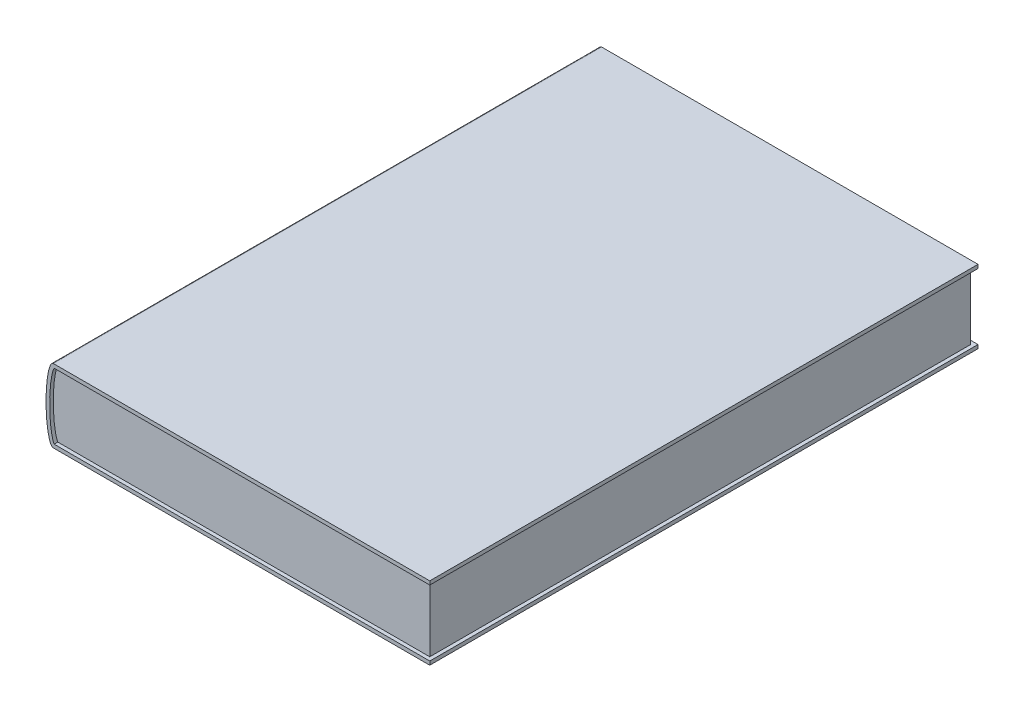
ISO-10303-21;
HEADER;
FILE_DESCRIPTION(('STEP AP214'),'2;1');
FILE_NAME('part.step','',(''),(''),'','','');
FILE_SCHEMA(('AUTOMOTIVE_DESIGN { 1 0 10303 214 1 1 1 1 }'));
ENDSEC;
DATA;
#1=APPLICATION_CONTEXT('core data for automotive mechanical design processes');
#2=APPLICATION_PROTOCOL_DEFINITION('international standard','automotive_design',2000,#1);
#3=PRODUCT_CONTEXT('',#1,'mechanical');
#4=PRODUCT('Part','Part','',(#3));
#5=PRODUCT_RELATED_PRODUCT_CATEGORY('part','',(#4));
#6=PRODUCT_DEFINITION_FORMATION('','',#4);
#7=PRODUCT_DEFINITION_CONTEXT('part definition',#1,'design');
#8=PRODUCT_DEFINITION('design','',#6,#7);
#9=PRODUCT_DEFINITION_SHAPE('','',#8);
#10=(LENGTH_UNIT() NAMED_UNIT(*) SI_UNIT(.MILLI.,.METRE.));
#11=(NAMED_UNIT(*) PLANE_ANGLE_UNIT() SI_UNIT($,.RADIAN.));
#12=(NAMED_UNIT(*) SI_UNIT($,.STERADIAN.) SOLID_ANGLE_UNIT());
#13=UNCERTAINTY_MEASURE_WITH_UNIT(LENGTH_MEASURE(1.E-05),#10,'distance_accuracy_value','');
#14=(GEOMETRIC_REPRESENTATION_CONTEXT(3) GLOBAL_UNCERTAINTY_ASSIGNED_CONTEXT((#13)) GLOBAL_UNIT_ASSIGNED_CONTEXT((#10,
#11,#12)) REPRESENTATION_CONTEXT('',''));
#15=CARTESIAN_POINT('',(0.,0.,0.));
#16=DIRECTION('',(0.,0.,1.));
#17=DIRECTION('',(1.,0.,0.));
#18=AXIS2_PLACEMENT_3D('',#15,#16,#17);
#19=CARTESIAN_POINT('',(-102.515867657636,-17.9999999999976,150.));
#20=DIRECTION('',(0.,-1.,0.));
#21=DIRECTION('',(1.,0.,0.));
#22=AXIS2_PLACEMENT_3D('',#19,#20,#21);
#23=PLANE('',#22);
#24=DIRECTION('',(1.,0.,0.));
#25=VECTOR('',#24,1.);
#26=CARTESIAN_POINT('',(-102.515867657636,-17.9999999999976,148.));
#27=LINE('',#26,#25);
#28=CARTESIAN_POINT('',(-102.515867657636,-17.9999999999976,148.));
#29=VERTEX_POINT('',#28);
#30=CARTESIAN_POINT('',(101.,-17.9999999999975,148.));
#31=VERTEX_POINT('',#30);
#32=EDGE_CURVE('E252',#29,#31,#27,.T.);
#33=ORIENTED_EDGE('',*,*,#32,.F.);
#34=DIRECTION('',(0.,0.,-1.));
#35=VECTOR('',#34,1.);
#36=CARTESIAN_POINT('',(-102.515867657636,-17.9999999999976,150.));
#37=LINE('',#36,#35);
#38=CARTESIAN_POINT('',(-102.515867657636,-17.9999999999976,150.));
#39=VERTEX_POINT('',#38);
#40=EDGE_CURVE('E47',#39,#29,#37,.T.);
#41=ORIENTED_EDGE('',*,*,#40,.F.);
#42=DIRECTION('',(-1.,0.,0.));
#43=VECTOR('',#42,1.);
#44=CARTESIAN_POINT('',(-102.515867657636,-17.9999999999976,150.));
#45=LINE('',#44,#43);
#46=CARTESIAN_POINT('',(103.,-18.,150.));
#47=VERTEX_POINT('',#46);
#48=EDGE_CURVE('E104',#47,#39,#45,.T.);
#49=ORIENTED_EDGE('',*,*,#48,.F.);
#50=DIRECTION('',(0.,0.,-1.));
#51=VECTOR('',#50,1.);
#52=CARTESIAN_POINT('',(103.,-18.,150.));
#53=LINE('',#52,#51);
#54=CARTESIAN_POINT('',(103.,-18.,-150.));
#55=VERTEX_POINT('',#54);
#56=EDGE_CURVE('E11',#47,#55,#53,.T.);
#57=ORIENTED_EDGE('',*,*,#56,.T.);
#58=DIRECTION('',(-1.,0.,0.));
#59=VECTOR('',#58,1.);
#60=CARTESIAN_POINT('',(-102.515867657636,-17.9999999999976,-150.));
#61=LINE('',#60,#59);
#62=CARTESIAN_POINT('',(-102.515867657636,-17.9999999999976,-150.));
#63=VERTEX_POINT('',#62);
#64=EDGE_CURVE('E212',#55,#63,#61,.T.);
#65=ORIENTED_EDGE('',*,*,#64,.T.);
#66=CARTESIAN_POINT('',(-102.515867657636,-17.9999999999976,-148.));
#67=VERTEX_POINT('',#66);
#68=EDGE_CURVE('E199',#67,#63,#37,.T.);
#69=ORIENTED_EDGE('',*,*,#68,.F.);
#70=DIRECTION('',(1.,0.,0.));
#71=VECTOR('',#70,1.);
#72=CARTESIAN_POINT('',(-102.515867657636,-17.9999999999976,-148.));
#73=LINE('',#72,#71);
#74=CARTESIAN_POINT('',(101.,-17.9999999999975,-148.));
#75=VERTEX_POINT('',#74);
#76=EDGE_CURVE('E267',#67,#75,#73,.T.);
#77=ORIENTED_EDGE('',*,*,#76,.T.);
#78=DIRECTION('',(0.,0.,-1.));
#79=VECTOR('',#78,1.);
#80=CARTESIAN_POINT('',(101.,-17.9999999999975,148.));
#81=LINE('',#80,#79);
#82=EDGE_CURVE('E236',#31,#75,#81,.T.);
#83=ORIENTED_EDGE('',*,*,#82,.F.);
#84=EDGE_LOOP('',(#33,#41,#49,#57,#65,#69,#77,#83));
#85=FACE_BOUND('',#84,.T.);
#86=ADVANCED_FACE('F39',(#85),#23,.F.);
#87=CARTESIAN_POINT('',(-102.515867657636,-17.9999999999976,150.));
#88=CARTESIAN_POINT('',(-102.54790510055,-17.9493335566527,150.));
#89=CARTESIAN_POINT('',(-102.603716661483,-17.8548623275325,150.));
#90=CARTESIAN_POINT('',(-102.743990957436,-17.5881350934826,150.));
#91=CARTESIAN_POINT('',(-102.93212011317,-17.1643070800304,150.));
#92=CARTESIAN_POINT('',(-103.169750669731,-16.5114393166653,150.));
#93=CARTESIAN_POINT('',(-103.485635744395,-15.4715657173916,150.));
#94=CARTESIAN_POINT('',(-103.863661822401,-13.8798777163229,150.));
#95=CARTESIAN_POINT('',(-104.260229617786,-11.5815238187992,150.));
#96=CARTESIAN_POINT('',(-104.583265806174,-8.96782562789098,150.));
#97=CARTESIAN_POINT('',(-104.900962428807,-5.16281343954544,150.));
#98=CARTESIAN_POINT('',(-105.066025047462,7.0384236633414E-12,150.));
#99=CARTESIAN_POINT('',(-104.900962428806,5.1628134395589,150.));
#100=CARTESIAN_POINT('',(-104.583265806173,8.96782562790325,150.));
#101=CARTESIAN_POINT('',(-104.260229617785,11.5815238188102,150.));
#102=CARTESIAN_POINT('',(-103.863661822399,13.8798777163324,150.));
#103=CARTESIAN_POINT('',(-103.485635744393,15.4715657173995,150.));
#104=CARTESIAN_POINT('',(-103.169750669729,16.5114393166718,150.));
#105=CARTESIAN_POINT('',(-102.932120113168,17.1643070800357,150.));
#106=CARTESIAN_POINT('',(-102.743990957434,17.5881350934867,150.));
#107=CARTESIAN_POINT('',(-102.603716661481,17.8548623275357,150.));
#108=CARTESIAN_POINT('',(-102.547905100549,17.9493335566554,150.));
#109=CARTESIAN_POINT('',(-102.515867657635,18.,150.));
#110=B_SPLINE_CURVE_WITH_KNOTS('',3,(#87,#88,#89,#90,#91,#92,#93,#94,#95,#96,#97,#98,#99,#100,
#101,#102,#103,#104,#105,#106,#107,#108,#109),.UNSPECIFIED.,.F.,.F.,(4,1,1,1,1,1,1,1,1,1,1,1,1,
1,1,1,1,1,1,1,4),(0.306338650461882,0.345852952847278,0.385367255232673,0.464395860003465,
0.543424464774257,0.622453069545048,0.780510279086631,0.938567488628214,1.0966246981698,
1.25468190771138,1.57079632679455,1.88691074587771,2.04496795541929,2.20302516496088,
2.36108237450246,2.51913958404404,2.59816818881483,2.67719679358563,2.75622539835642,
2.79573970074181,2.83525400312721),.UNSPECIFIED.);
#111=DIRECTION('',(0.,0.,-1.));
#112=VECTOR('',#111,1.);
#113=SURFACE_OF_LINEAR_EXTRUSION('',#110,#112);
#114=CARTESIAN_POINT('',(-102.515867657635,18.,148.));
#115=CARTESIAN_POINT('',(-102.547905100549,17.9493335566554,148.));
#116=CARTESIAN_POINT('',(-102.603716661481,17.8548623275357,148.));
#117=CARTESIAN_POINT('',(-102.743990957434,17.5881350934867,148.));
#118=CARTESIAN_POINT('',(-102.932120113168,17.1643070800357,148.));
#119=CARTESIAN_POINT('',(-103.169750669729,16.5114393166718,148.));
#120=CARTESIAN_POINT('',(-103.485635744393,15.4715657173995,148.));
#121=CARTESIAN_POINT('',(-103.863661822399,13.8798777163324,148.));
#122=CARTESIAN_POINT('',(-104.260229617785,11.5815238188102,148.));
#123=CARTESIAN_POINT('',(-104.583265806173,8.96782562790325,148.));
#124=CARTESIAN_POINT('',(-104.900962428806,5.1628134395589,148.));
#125=CARTESIAN_POINT('',(-105.066025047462,7.0384236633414E-12,148.));
#126=CARTESIAN_POINT('',(-104.900962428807,-5.16281343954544,148.));
#127=CARTESIAN_POINT('',(-104.583265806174,-8.96782562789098,148.));
#128=CARTESIAN_POINT('',(-104.260229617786,-11.5815238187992,148.));
#129=CARTESIAN_POINT('',(-103.863661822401,-13.8798777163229,148.));
#130=CARTESIAN_POINT('',(-103.485635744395,-15.4715657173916,148.));
#131=CARTESIAN_POINT('',(-103.169750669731,-16.5114393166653,148.));
#132=CARTESIAN_POINT('',(-102.93212011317,-17.1643070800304,148.));
#133=CARTESIAN_POINT('',(-102.743990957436,-17.5881350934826,148.));
#134=CARTESIAN_POINT('',(-102.603716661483,-17.8548623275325,148.));
#135=CARTESIAN_POINT('',(-102.54790510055,-17.9493335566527,148.));
#136=CARTESIAN_POINT('',(-102.515867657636,-17.9999999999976,148.));
#137=B_SPLINE_CURVE_WITH_KNOTS('',3,(#114,#115,#116,#117,#118,#119,#120,#121,#122,#123,#124,
#125,#126,#127,#128,#129,#130,#131,#132,#133,#134,#135,#136),.UNSPECIFIED.,.F.,.F.,(4,1,1,1,1,1,
1,1,1,1,1,1,1,1,1,1,1,1,1,1,4),(0.306338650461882,0.345852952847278,0.385367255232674,
0.464395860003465,0.543424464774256,0.622453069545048,0.780510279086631,0.938567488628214,
1.0966246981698,1.25468190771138,1.57079632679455,1.88691074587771,2.04496795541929,
2.20302516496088,2.36108237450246,2.51913958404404,2.59816818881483,2.67719679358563,
2.75622539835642,2.79573970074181,2.83525400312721),.UNSPECIFIED.);
#138=CARTESIAN_POINT('',(-102.515867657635,18.,148.));
#139=VERTEX_POINT('',#138);
#140=EDGE_CURVE('E255',#139,#29,#137,.T.);
#141=ORIENTED_EDGE('',*,*,#140,.F.);
#142=DIRECTION('',(0.,0.,-1.));
#143=VECTOR('',#142,1.);
#144=CARTESIAN_POINT('',(-102.515867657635,18.,150.));
#145=LINE('',#144,#143);
#146=CARTESIAN_POINT('',(-102.515867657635,18.,150.));
#147=VERTEX_POINT('',#146);
#148=EDGE_CURVE('E198',#147,#139,#145,.T.);
#149=ORIENTED_EDGE('',*,*,#148,.F.);
#150=EDGE_CURVE('E170',#39,#147,#110,.T.);
#151=ORIENTED_EDGE('',*,*,#150,.F.);
#152=ORIENTED_EDGE('',*,*,#40,.T.);
#153=EDGE_LOOP('',(#141,#149,#151,#152));
#154=FACE_BOUND('',#153,.T.);
#155=ADVANCED_FACE('F165',(#154),#113,.F.);
#156=CARTESIAN_POINT('',(103.,18.,150.));
#157=DIRECTION('',(0.,1.,0.));
#158=DIRECTION('',(0.,0.,1.));
#159=AXIS2_PLACEMENT_3D('',#156,#157,#158);
#160=PLANE('',#159);
#161=DIRECTION('',(-1.,0.,0.));
#162=VECTOR('',#161,1.);
#163=CARTESIAN_POINT('',(101.,18.,148.));
#164=LINE('',#163,#162);
#165=CARTESIAN_POINT('',(101.,18.,148.));
#166=VERTEX_POINT('',#165);
#167=EDGE_CURVE('E257',#166,#139,#164,.T.);
#168=ORIENTED_EDGE('',*,*,#167,.F.);
#169=DIRECTION('',(0.,0.,-1.));
#170=VECTOR('',#169,1.);
#171=CARTESIAN_POINT('',(101.,18.,148.));
#172=LINE('',#171,#170);
#173=CARTESIAN_POINT('',(101.,18.,-148.));
#174=VERTEX_POINT('',#173);
#175=EDGE_CURVE('E238',#166,#174,#172,.T.);
#176=ORIENTED_EDGE('',*,*,#175,.T.);
#177=DIRECTION('',(-1.,0.,0.));
#178=VECTOR('',#177,1.);
#179=CARTESIAN_POINT('',(101.,18.,-148.));
#180=LINE('',#179,#178);
#181=CARTESIAN_POINT('',(-102.515867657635,18.,-148.));
#182=VERTEX_POINT('',#181);
#183=EDGE_CURVE('E271',#174,#182,#180,.T.);
#184=ORIENTED_EDGE('',*,*,#183,.T.);
#185=CARTESIAN_POINT('',(-102.515867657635,18.,-150.));
#186=VERTEX_POINT('',#185);
#187=EDGE_CURVE('E192',#182,#186,#145,.T.);
#188=ORIENTED_EDGE('',*,*,#187,.T.);
#189=DIRECTION('',(1.,0.,0.));
#190=VECTOR('',#189,1.);
#191=CARTESIAN_POINT('',(103.,18.,-150.));
#192=LINE('',#191,#190);
#193=CARTESIAN_POINT('',(103.,18.,-150.));
#194=VERTEX_POINT('',#193);
#195=EDGE_CURVE('E190',#186,#194,#192,.T.);
#196=ORIENTED_EDGE('',*,*,#195,.T.);
#197=DIRECTION('',(0.,0.,-1.));
#198=VECTOR('',#197,1.);
#199=CARTESIAN_POINT('',(103.,18.,150.));
#200=LINE('',#199,#198);
#201=CARTESIAN_POINT('',(103.,18.,150.));
#202=VERTEX_POINT('',#201);
#203=EDGE_CURVE('E187',#202,#194,#200,.T.);
#204=ORIENTED_EDGE('',*,*,#203,.F.);
#205=DIRECTION('',(1.,0.,0.));
#206=VECTOR('',#205,1.);
#207=CARTESIAN_POINT('',(103.,18.,150.));
#208=LINE('',#207,#206);
#209=EDGE_CURVE('E176',#147,#202,#208,.T.);
#210=ORIENTED_EDGE('',*,*,#209,.F.);
#211=ORIENTED_EDGE('',*,*,#148,.T.);
#212=EDGE_LOOP('',(#168,#176,#184,#188,#196,#204,#210,#211));
#213=FACE_BOUND('',#212,.T.);
#214=ADVANCED_FACE('F162',(#213),#160,.F.);
#215=CARTESIAN_POINT('',(103.,-18.,150.));
#216=DIRECTION('',(-1.,0.,0.));
#217=DIRECTION('',(0.,0.,1.));
#218=AXIS2_PLACEMENT_3D('',#215,#216,#217);
#219=PLANE('',#218);
#220=DIRECTION('',(0.,1.,0.));
#221=VECTOR('',#220,1.);
#222=CARTESIAN_POINT('',(103.,-18.,-150.));
#223=LINE('',#222,#221);
#224=CARTESIAN_POINT('',(103.,-19.9999999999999,-150.));
#225=VERTEX_POINT('',#224);
#226=EDGE_CURVE('E218',#225,#55,#223,.T.);
#227=ORIENTED_EDGE('',*,*,#226,.T.);
#228=ORIENTED_EDGE('',*,*,#56,.F.);
#229=DIRECTION('',(0.,1.,0.));
#230=VECTOR('',#229,1.);
#231=CARTESIAN_POINT('',(103.,-18.,150.));
#232=LINE('',#231,#230);
#233=CARTESIAN_POINT('',(103.,-19.9999999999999,150.));
#234=VERTEX_POINT('',#233);
#235=EDGE_CURVE('E234',#234,#47,#232,.T.);
#236=ORIENTED_EDGE('',*,*,#235,.F.);
#237=DIRECTION('',(0.,0.,-1.));
#238=VECTOR('',#237,1.);
#239=CARTESIAN_POINT('',(103.,-19.9999999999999,150.));
#240=LINE('',#239,#238);
#241=EDGE_CURVE('E144',#234,#225,#240,.T.);
#242=ORIENTED_EDGE('',*,*,#241,.T.);
#243=EDGE_LOOP('',(#227,#228,#236,#242));
#244=FACE_BOUND('',#243,.T.);
#245=ADVANCED_FACE('F41',(#244),#219,.F.);
#246=ORIENTED_EDGE('',*,*,#187,.F.);
#247=CARTESIAN_POINT('',(-102.515867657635,18.,-148.));
#248=CARTESIAN_POINT('',(-102.547905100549,17.9493335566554,-148.));
#249=CARTESIAN_POINT('',(-102.603716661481,17.8548623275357,-148.));
#250=CARTESIAN_POINT('',(-102.743990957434,17.5881350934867,-148.));
#251=CARTESIAN_POINT('',(-102.932120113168,17.1643070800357,-148.));
#252=CARTESIAN_POINT('',(-103.169750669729,16.5114393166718,-148.));
#253=CARTESIAN_POINT('',(-103.485635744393,15.4715657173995,-148.));
#254=CARTESIAN_POINT('',(-103.863661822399,13.8798777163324,-148.));
#255=CARTESIAN_POINT('',(-104.260229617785,11.5815238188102,-148.));
#256=CARTESIAN_POINT('',(-104.583265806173,8.96782562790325,-148.));
#257=CARTESIAN_POINT('',(-104.900962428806,5.1628134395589,-148.));
#258=CARTESIAN_POINT('',(-105.066025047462,7.0384236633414E-12,-148.));
#259=CARTESIAN_POINT('',(-104.900962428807,-5.16281343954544,-148.));
#260=CARTESIAN_POINT('',(-104.583265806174,-8.96782562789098,-148.));
#261=CARTESIAN_POINT('',(-104.260229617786,-11.5815238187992,-148.));
#262=CARTESIAN_POINT('',(-103.863661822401,-13.8798777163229,-148.));
#263=CARTESIAN_POINT('',(-103.485635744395,-15.4715657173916,-148.));
#264=CARTESIAN_POINT('',(-103.169750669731,-16.5114393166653,-148.));
#265=CARTESIAN_POINT('',(-102.93212011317,-17.1643070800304,-148.));
#266=CARTESIAN_POINT('',(-102.743990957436,-17.5881350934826,-148.));
#267=CARTESIAN_POINT('',(-102.603716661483,-17.8548623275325,-148.));
#268=CARTESIAN_POINT('',(-102.54790510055,-17.9493335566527,-148.));
#269=CARTESIAN_POINT('',(-102.515867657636,-17.9999999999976,-148.));
#270=B_SPLINE_CURVE_WITH_KNOTS('',3,(#247,#248,#249,#250,#251,#252,#253,#254,#255,#256,#257,
#258,#259,#260,#261,#262,#263,#264,#265,#266,#267,#268,#269),.UNSPECIFIED.,.F.,.F.,(4,1,1,1,1,1,
1,1,1,1,1,1,1,1,1,1,1,1,1,1,4),(0.306338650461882,0.345852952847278,0.385367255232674,
0.464395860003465,0.543424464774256,0.622453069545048,0.780510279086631,0.938567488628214,
1.0966246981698,1.25468190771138,1.57079632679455,1.88691074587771,2.04496795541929,
2.20302516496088,2.36108237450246,2.51913958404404,2.59816818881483,2.67719679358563,
2.75622539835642,2.79573970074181,2.83525400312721),.UNSPECIFIED.);
#271=EDGE_CURVE('E54',#182,#67,#270,.T.);
#272=ORIENTED_EDGE('',*,*,#271,.T.);
#273=ORIENTED_EDGE('',*,*,#68,.T.);
#274=CARTESIAN_POINT('',(-102.515867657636,-17.9999999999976,-150.));
#275=CARTESIAN_POINT('',(-102.54790510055,-17.9493335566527,-150.));
#276=CARTESIAN_POINT('',(-102.603716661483,-17.8548623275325,-150.));
#277=CARTESIAN_POINT('',(-102.743990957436,-17.5881350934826,-150.));
#278=CARTESIAN_POINT('',(-102.93212011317,-17.1643070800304,-150.));
#279=CARTESIAN_POINT('',(-103.169750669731,-16.5114393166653,-150.));
#280=CARTESIAN_POINT('',(-103.485635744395,-15.4715657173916,-150.));
#281=CARTESIAN_POINT('',(-103.863661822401,-13.8798777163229,-150.));
#282=CARTESIAN_POINT('',(-104.260229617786,-11.5815238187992,-150.));
#283=CARTESIAN_POINT('',(-104.583265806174,-8.96782562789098,-150.));
#284=CARTESIAN_POINT('',(-104.900962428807,-5.16281343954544,-150.));
#285=CARTESIAN_POINT('',(-105.066025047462,7.0384236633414E-12,-150.));
#286=CARTESIAN_POINT('',(-104.900962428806,5.1628134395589,-150.));
#287=CARTESIAN_POINT('',(-104.583265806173,8.96782562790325,-150.));
#288=CARTESIAN_POINT('',(-104.260229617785,11.5815238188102,-150.));
#289=CARTESIAN_POINT('',(-103.863661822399,13.8798777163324,-150.));
#290=CARTESIAN_POINT('',(-103.485635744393,15.4715657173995,-150.));
#291=CARTESIAN_POINT('',(-103.169750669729,16.5114393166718,-150.));
#292=CARTESIAN_POINT('',(-102.932120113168,17.1643070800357,-150.));
#293=CARTESIAN_POINT('',(-102.743990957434,17.5881350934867,-150.));
#294=CARTESIAN_POINT('',(-102.603716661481,17.8548623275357,-150.));
#295=CARTESIAN_POINT('',(-102.547905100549,17.9493335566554,-150.));
#296=CARTESIAN_POINT('',(-102.515867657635,18.,-150.));
#297=B_SPLINE_CURVE_WITH_KNOTS('',3,(#274,#275,#276,#277,#278,#279,#280,#281,#282,#283,#284,
#285,#286,#287,#288,#289,#290,#291,#292,#293,#294,#295,#296),.UNSPECIFIED.,.F.,.F.,(4,1,1,1,1,1,
1,1,1,1,1,1,1,1,1,1,1,1,1,1,4),(0.306338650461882,0.345852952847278,0.385367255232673,
0.464395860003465,0.543424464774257,0.622453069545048,0.780510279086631,0.938567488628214,
1.0966246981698,1.25468190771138,1.57079632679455,1.88691074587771,2.04496795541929,
2.20302516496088,2.36108237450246,2.51913958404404,2.59816818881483,2.67719679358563,
2.75622539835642,2.79573970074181,2.83525400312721),.UNSPECIFIED.);
#298=EDGE_CURVE('E209',#63,#186,#297,.T.);
#299=ORIENTED_EDGE('',*,*,#298,.T.);
#300=EDGE_LOOP('',(#246,#272,#273,#299));
#301=FACE_BOUND('',#300,.T.);
#302=ADVANCED_FACE('F160',(#301),#113,.F.);
#303=CARTESIAN_POINT('',(103.,20.,150.));
#304=DIRECTION('',(-1.,0.,0.));
#305=DIRECTION('',(0.,0.,1.));
#306=AXIS2_PLACEMENT_3D('',#303,#304,#305);
#307=PLANE('',#306);
#308=DIRECTION('',(0.,1.,0.));
#309=VECTOR('',#308,1.);
#310=CARTESIAN_POINT('',(103.,20.,-150.));
#311=LINE('',#310,#309);
#312=CARTESIAN_POINT('',(103.,20.,-150.));
#313=VERTEX_POINT('',#312);
#314=EDGE_CURVE('E194',#194,#313,#311,.T.);
#315=ORIENTED_EDGE('',*,*,#314,.T.);
#316=DIRECTION('',(0.,0.,-1.));
#317=VECTOR('',#316,1.);
#318=CARTESIAN_POINT('',(103.,20.,150.));
#319=LINE('',#318,#317);
#320=CARTESIAN_POINT('',(103.,20.,150.));
#321=VERTEX_POINT('',#320);
#322=EDGE_CURVE('E139',#321,#313,#319,.T.);
#323=ORIENTED_EDGE('',*,*,#322,.F.);
#324=DIRECTION('',(0.,1.,0.));
#325=VECTOR('',#324,1.);
#326=CARTESIAN_POINT('',(103.,20.,150.));
#327=LINE('',#326,#325);
#328=EDGE_CURVE('E127',#202,#321,#327,.T.);
#329=ORIENTED_EDGE('',*,*,#328,.F.);
#330=ORIENTED_EDGE('',*,*,#203,.T.);
#331=EDGE_LOOP('',(#315,#323,#329,#330));
#332=FACE_BOUND('',#331,.T.);
#333=ADVANCED_FACE('F157',(#332),#307,.F.);
#334=CARTESIAN_POINT('',(103.,20.,150.));
#335=DIRECTION('',(0.,-1.,0.));
#336=DIRECTION('',(1.,0.,0.));
#337=AXIS2_PLACEMENT_3D('',#334,#335,#336);
#338=PLANE('',#337);
#339=DIRECTION('',(-1.,0.,0.));
#340=VECTOR('',#339,1.);
#341=CARTESIAN_POINT('',(103.,20.,-150.));
#342=LINE('',#341,#340);
#343=CARTESIAN_POINT('',(-103.,20.,-150.));
#344=VERTEX_POINT('',#343);
#345=EDGE_CURVE('E136',#313,#344,#342,.T.);
#346=ORIENTED_EDGE('',*,*,#345,.T.);
#347=DIRECTION('',(0.,0.,-1.));
#348=VECTOR('',#347,1.);
#349=CARTESIAN_POINT('',(-103.,20.,150.));
#350=LINE('',#349,#348);
#351=CARTESIAN_POINT('',(-103.,20.,150.));
#352=VERTEX_POINT('',#351);
#353=EDGE_CURVE('E133',#352,#344,#350,.T.);
#354=ORIENTED_EDGE('',*,*,#353,.F.);
#355=DIRECTION('',(-1.,0.,0.));
#356=VECTOR('',#355,1.);
#357=CARTESIAN_POINT('',(103.,20.,150.));
#358=LINE('',#357,#356);
#359=EDGE_CURVE('E120',#321,#352,#358,.T.);
#360=ORIENTED_EDGE('',*,*,#359,.F.);
#361=ORIENTED_EDGE('',*,*,#322,.T.);
#362=EDGE_LOOP('',(#346,#354,#360,#361));
#363=FACE_BOUND('',#362,.T.);
#364=ADVANCED_FACE('F134',(#363),#338,.F.);
#365=CARTESIAN_POINT('',(-103.,0.,150.));
#366=DIRECTION('',(0.,0.,1.));
#367=DIRECTION('',(0.,1.,0.));
#368=AXIS2_PLACEMENT_3D('',#365,#366,#367);
#369=ELLIPSE('',#368,20.,4.);
#370=DIRECTION('',(0.,0.,-1.));
#371=VECTOR('',#370,1.);
#372=SURFACE_OF_LINEAR_EXTRUSION('',#369,#371);
#373=CARTESIAN_POINT('',(-103.,0.,-150.));
#374=DIRECTION('',(0.,0.,1.));
#375=DIRECTION('',(0.,1.,0.));
#376=AXIS2_PLACEMENT_3D('',#373,#374,#375);
#377=ELLIPSE('',#376,20.,4.);
#378=CARTESIAN_POINT('',(-103.,-20.,-150.));
#379=VERTEX_POINT('',#378);
#380=EDGE_CURVE('E231',#344,#379,#377,.T.);
#381=ORIENTED_EDGE('',*,*,#380,.T.);
#382=DIRECTION('',(0.,0.,-1.));
#383=VECTOR('',#382,1.);
#384=CARTESIAN_POINT('',(-103.,-20.,150.));
#385=LINE('',#384,#383);
#386=CARTESIAN_POINT('',(-103.,-20.,150.));
#387=VERTEX_POINT('',#386);
#388=EDGE_CURVE('E140',#387,#379,#385,.T.);
#389=ORIENTED_EDGE('',*,*,#388,.F.);
#390=EDGE_CURVE('E124',#352,#387,#369,.T.);
#391=ORIENTED_EDGE('',*,*,#390,.F.);
#392=ORIENTED_EDGE('',*,*,#353,.T.);
#393=EDGE_LOOP('',(#381,#389,#391,#392));
#394=FACE_BOUND('',#393,.T.);
#395=ADVANCED_FACE('F142',(#394),#372,.F.);
#396=CARTESIAN_POINT('',(-103.,-20.,150.));
#397=DIRECTION('',(0.,1.,0.));
#398=DIRECTION('',(-1.,0.,0.));
#399=AXIS2_PLACEMENT_3D('',#396,#397,#398);
#400=PLANE('',#399);
#401=DIRECTION('',(1.,0.,0.));
#402=VECTOR('',#401,1.);
#403=CARTESIAN_POINT('',(-103.,-20.,-150.));
#404=LINE('',#403,#402);
#405=EDGE_CURVE('E96',#379,#225,#404,.T.);
#406=ORIENTED_EDGE('',*,*,#405,.T.);
#407=ORIENTED_EDGE('',*,*,#241,.F.);
#408=DIRECTION('',(1.,0.,0.));
#409=VECTOR('',#408,1.);
#410=CARTESIAN_POINT('',(-103.,-20.,150.));
#411=LINE('',#410,#409);
#412=EDGE_CURVE('E63',#387,#234,#411,.T.);
#413=ORIENTED_EDGE('',*,*,#412,.F.);
#414=ORIENTED_EDGE('',*,*,#388,.T.);
#415=EDGE_LOOP('',(#406,#407,#413,#414));
#416=FACE_BOUND('',#415,.T.);
#417=ADVANCED_FACE('F153',(#416),#400,.F.);
#418=CARTESIAN_POINT('',(-103.,0.,150.));
#419=DIRECTION('',(0.,0.,1.));
#420=DIRECTION('',(1.,0.,0.));
#421=AXIS2_PLACEMENT_3D('',#418,#419,#420);
#422=PLANE('',#421);
#423=ORIENTED_EDGE('',*,*,#235,.T.);
#424=ORIENTED_EDGE('',*,*,#48,.T.);
#425=ORIENTED_EDGE('',*,*,#150,.T.);
#426=ORIENTED_EDGE('',*,*,#209,.T.);
#427=ORIENTED_EDGE('',*,*,#328,.T.);
#428=ORIENTED_EDGE('',*,*,#359,.T.);
#429=ORIENTED_EDGE('',*,*,#390,.T.);
#430=ORIENTED_EDGE('',*,*,#412,.T.);
#431=EDGE_LOOP('',(#423,#424,#425,#426,#427,#428,#429,#430));
#432=FACE_BOUND('',#431,.T.);
#433=ADVANCED_FACE('F122',(#432),#422,.T.);
#434=CARTESIAN_POINT('',(-103.,0.,-150.));
#435=DIRECTION('',(0.,0.,1.));
#436=DIRECTION('',(1.,0.,0.));
#437=AXIS2_PLACEMENT_3D('',#434,#435,#436);
#438=PLANE('',#437);
#439=ORIENTED_EDGE('',*,*,#226,.F.);
#440=ORIENTED_EDGE('',*,*,#405,.F.);
#441=ORIENTED_EDGE('',*,*,#380,.F.);
#442=ORIENTED_EDGE('',*,*,#345,.F.);
#443=ORIENTED_EDGE('',*,*,#314,.F.);
#444=ORIENTED_EDGE('',*,*,#195,.F.);
#445=ORIENTED_EDGE('',*,*,#298,.F.);
#446=ORIENTED_EDGE('',*,*,#64,.F.);
#447=EDGE_LOOP('',(#439,#440,#441,#442,#443,#444,#445,#446));
#448=FACE_BOUND('',#447,.T.);
#449=ADVANCED_FACE('F220',(#448),#438,.F.);
#450=CARTESIAN_POINT('',(101.,18.,148.));
#451=DIRECTION('',(1.,0.,0.));
#452=DIRECTION('',(0.,0.,-1.));
#453=AXIS2_PLACEMENT_3D('',#450,#451,#452);
#454=PLANE('',#453);
#455=DIRECTION('',(0.,-1.,0.));
#456=VECTOR('',#455,1.);
#457=CARTESIAN_POINT('',(101.,18.,-148.));
#458=LINE('',#457,#456);
#459=EDGE_CURVE('E269',#174,#75,#458,.T.);
#460=ORIENTED_EDGE('',*,*,#459,.F.);
#461=ORIENTED_EDGE('',*,*,#175,.F.);
#462=DIRECTION('',(0.,-1.,0.));
#463=VECTOR('',#462,1.);
#464=CARTESIAN_POINT('',(101.,18.,148.));
#465=LINE('',#464,#463);
#466=EDGE_CURVE('E247',#166,#31,#465,.T.);
#467=ORIENTED_EDGE('',*,*,#466,.T.);
#468=ORIENTED_EDGE('',*,*,#82,.T.);
#469=EDGE_LOOP('',(#460,#461,#467,#468));
#470=FACE_BOUND('',#469,.T.);
#471=ADVANCED_FACE('F289',(#470),#454,.T.);
#472=CARTESIAN_POINT('',(-105.,6.91952780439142E-12,148.));
#473=DIRECTION('',(0.,0.,-1.));
#474=DIRECTION('',(-1.,0.,0.));
#475=AXIS2_PLACEMENT_3D('',#472,#473,#474);
#476=PLANE('',#475);
#477=ORIENTED_EDGE('',*,*,#167,.T.);
#478=ORIENTED_EDGE('',*,*,#140,.T.);
#479=ORIENTED_EDGE('',*,*,#32,.T.);
#480=ORIENTED_EDGE('',*,*,#466,.F.);
#481=EDGE_LOOP('',(#477,#478,#479,#480));
#482=FACE_BOUND('',#481,.T.);
#483=ADVANCED_FACE('F288',(#482),#476,.F.);
#484=CARTESIAN_POINT('',(-105.,6.91952780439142E-12,-148.));
#485=DIRECTION('',(0.,0.,-1.));
#486=DIRECTION('',(-1.,0.,0.));
#487=AXIS2_PLACEMENT_3D('',#484,#485,#486);
#488=PLANE('',#487);
#489=ORIENTED_EDGE('',*,*,#183,.F.);
#490=ORIENTED_EDGE('',*,*,#459,.T.);
#491=ORIENTED_EDGE('',*,*,#76,.F.);
#492=ORIENTED_EDGE('',*,*,#271,.F.);
#493=EDGE_LOOP('',(#489,#490,#491,#492));
#494=FACE_BOUND('',#493,.T.);
#495=ADVANCED_FACE('F268',(#494),#488,.T.);
#496=CLOSED_SHELL('',(#86,#155,#214,#245,#302,#333,#364,#395,#417,#433,#449,#471,#483,#495));
#497=MANIFOLD_SOLID_BREP('B2',#496);
#498=ADVANCED_BREP_SHAPE_REPRESENTATION('',(#18,#497),#14);
#499=SHAPE_DEFINITION_REPRESENTATION(#9,#498);
ENDSEC;
END-ISO-10303-21;
